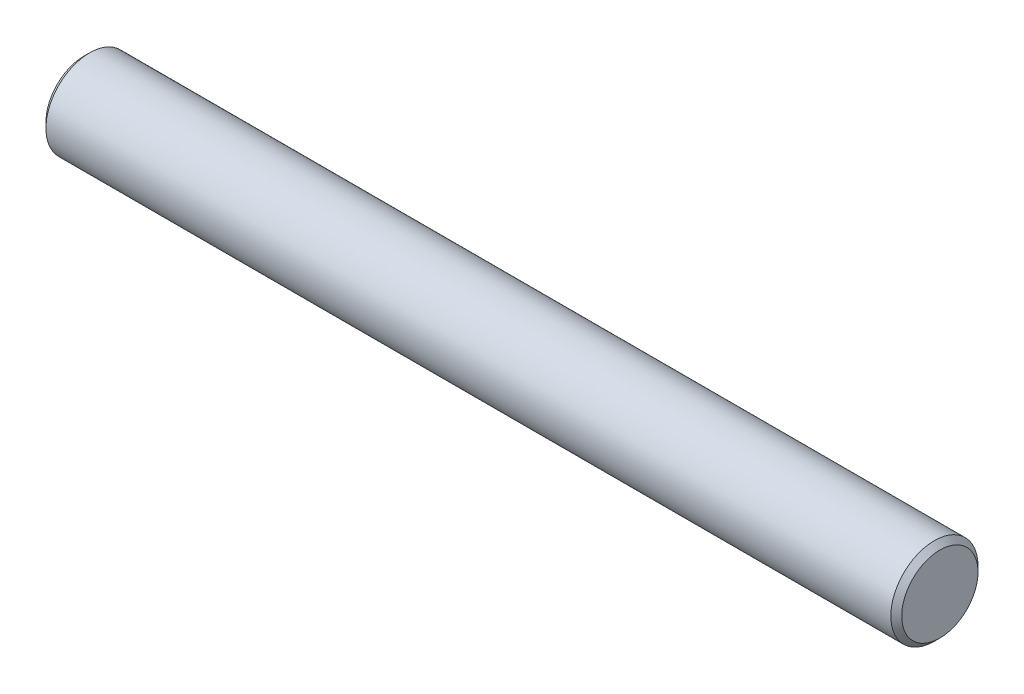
from build123d import *

# Parameters (mm, degrees)
SKETCH1_R      = 8
EXTRUDE1_DEPTH = 157
CHAMFER1_SIZE  = 1


with BuildPart() as part:
    # Sketch1 → Extrude1 (new body)
    with BuildSketch(Plane(origin=(0, 0, 0), x_dir=(0, 0, -1), z_dir=(1, 0, 0))):
        Circle(SKETCH1_R)
    extrude(amount=EXTRUDE1_DEPTH)

    # Chamfer1
    chamfer1_edges = [part.edges().sort_by_distance(p)[0] for p in [
        (0, 0, 8),
        (157, 0, 8),
    ]]
    chamfer(chamfer1_edges, length=CHAMFER1_SIZE)


solid = part.part
